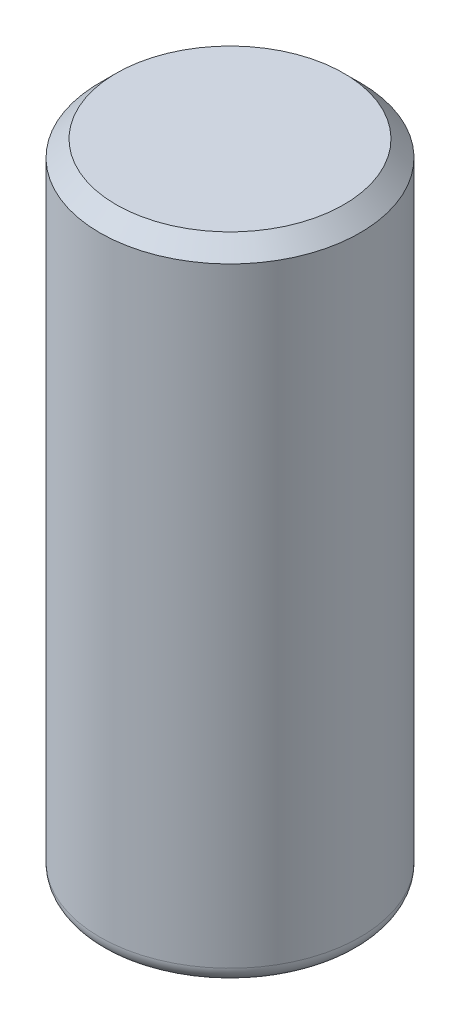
from build123d import *

# Parameters (mm, degrees)
SKETCH1_W     = 2.032
SKETCH1_H     = 10.033
FILLET1_R     = 0.254
CHAMFER1_SIZE = 0.254


with BuildPart() as part:
    # Sketch1 → Revolve1 (revolve)
    with BuildSketch(Plane.XY, mode=Mode.PRIVATE) as revolve1_sk:
        with Locations((-1.016, 5.0165)):
            Rectangle(SKETCH1_W, SKETCH1_H)
    revolve(revolve1_sk.sketch.rotate(Axis((0, 7.982954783, 0), (0, -1, 0)), 270), axis=Axis((0, 7.982954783, 0), (0, -1, 0)))

    # Fillet1
    fillet1_edges = [part.edges().sort_by_distance(p)[0] for p in [
        (0, 0, -2.032),
    ]]
    fillet(fillet1_edges, radius=FILLET1_R)

    # Chamfer1
    chamfer1_edges = [part.edges().sort_by_distance(p)[0] for p in [
        (0, 10.033, -2.032),
    ]]
    chamfer(chamfer1_edges, length=CHAMFER1_SIZE)


solid = part.part
